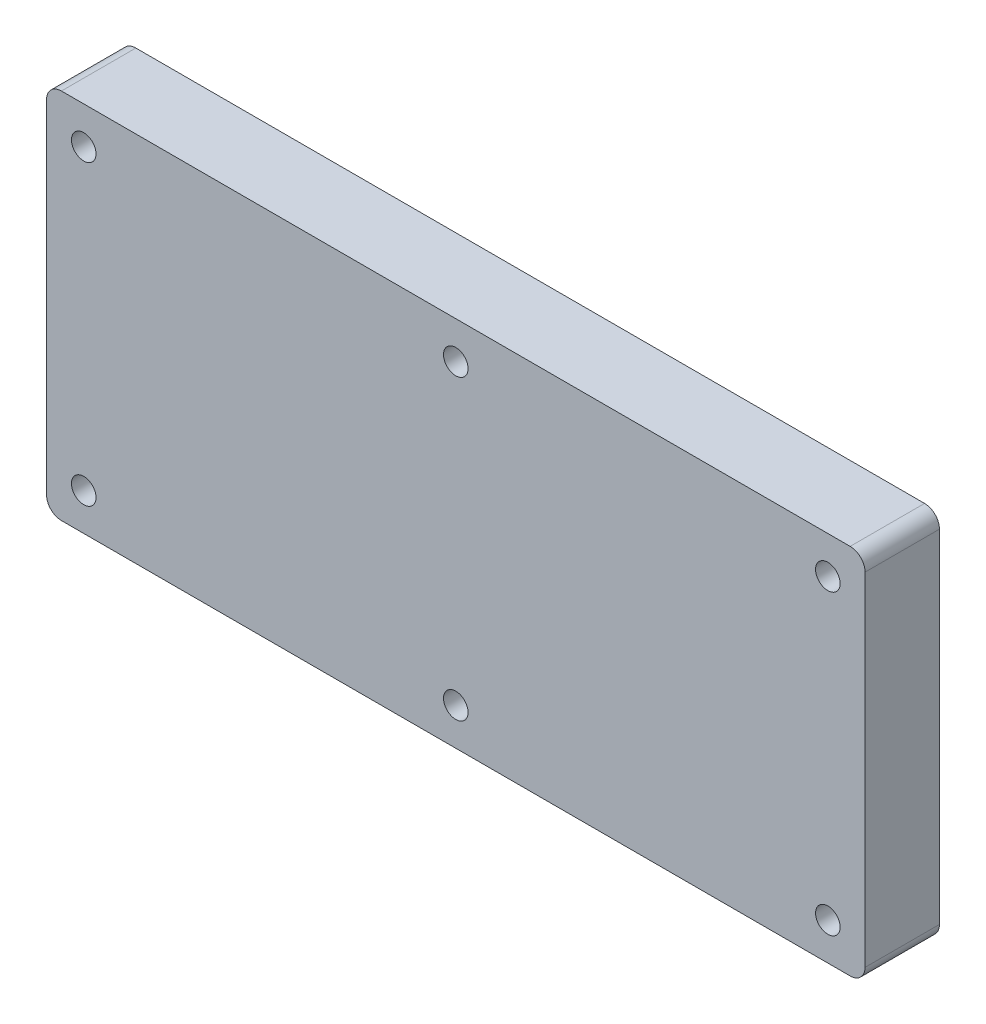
ISO-10303-21;
HEADER;
FILE_DESCRIPTION(('STEP AP214'),'2;1');
FILE_NAME('part.step','',(''),(''),'','','');
FILE_SCHEMA(('AUTOMOTIVE_DESIGN { 1 0 10303 214 1 1 1 1 }'));
ENDSEC;
DATA;
#1=APPLICATION_CONTEXT('core data for automotive mechanical design processes');
#2=APPLICATION_PROTOCOL_DEFINITION('international standard','automotive_design',2000,#1);
#3=PRODUCT_CONTEXT('',#1,'mechanical');
#4=PRODUCT('Part','Part','',(#3));
#5=PRODUCT_RELATED_PRODUCT_CATEGORY('part','',(#4));
#6=PRODUCT_DEFINITION_FORMATION('','',#4);
#7=PRODUCT_DEFINITION_CONTEXT('part definition',#1,'design');
#8=PRODUCT_DEFINITION('design','',#6,#7);
#9=PRODUCT_DEFINITION_SHAPE('','',#8);
#10=(LENGTH_UNIT() NAMED_UNIT(*) SI_UNIT(.MILLI.,.METRE.));
#11=(NAMED_UNIT(*) PLANE_ANGLE_UNIT() SI_UNIT($,.RADIAN.));
#12=(NAMED_UNIT(*) SI_UNIT($,.STERADIAN.) SOLID_ANGLE_UNIT());
#13=UNCERTAINTY_MEASURE_WITH_UNIT(LENGTH_MEASURE(1.E-05),#10,'distance_accuracy_value','');
#14=(GEOMETRIC_REPRESENTATION_CONTEXT(3) GLOBAL_UNCERTAINTY_ASSIGNED_CONTEXT((#13)) GLOBAL_UNIT_ASSIGNED_CONTEXT((#10,
#11,#12)) REPRESENTATION_CONTEXT('',''));
#15=CARTESIAN_POINT('',(0.,0.,0.));
#16=DIRECTION('',(0.,0.,1.));
#17=DIRECTION('',(1.,0.,0.));
#18=AXIS2_PLACEMENT_3D('',#15,#16,#17);
#19=CARTESIAN_POINT('',(55.,25.,10.));
#20=DIRECTION('',(-1.,0.,0.));
#21=DIRECTION('',(0.,-1.,0.));
#22=AXIS2_PLACEMENT_3D('',#19,#20,#21);
#23=PLANE('',#22);
#24=DIRECTION('',(0.,1.,0.));
#25=VECTOR('',#24,1.);
#26=CARTESIAN_POINT('',(55.,25.,0.));
#27=LINE('',#26,#25);
#28=CARTESIAN_POINT('',(55.,-23.,0.));
#29=VERTEX_POINT('',#28);
#30=CARTESIAN_POINT('',(55.,23.,0.));
#31=VERTEX_POINT('',#30);
#32=EDGE_CURVE('E134',#29,#31,#27,.T.);
#33=ORIENTED_EDGE('',*,*,#32,.T.);
#34=DIRECTION('',(0.,0.,-1.));
#35=VECTOR('',#34,1.);
#36=CARTESIAN_POINT('',(55.,23.,10.));
#37=LINE('',#36,#35);
#38=CARTESIAN_POINT('',(55.,23.,10.));
#39=VERTEX_POINT('',#38);
#40=EDGE_CURVE('E112',#31,#39,#37,.F.);
#41=ORIENTED_EDGE('',*,*,#40,.T.);
#42=DIRECTION('',(0.,1.,0.));
#43=VECTOR('',#42,1.);
#44=CARTESIAN_POINT('',(55.,25.,10.));
#45=LINE('',#44,#43);
#46=CARTESIAN_POINT('',(55.,-23.,10.));
#47=VERTEX_POINT('',#46);
#48=EDGE_CURVE('E144',#47,#39,#45,.T.);
#49=ORIENTED_EDGE('',*,*,#48,.F.);
#50=DIRECTION('',(0.,0.,-1.));
#51=VECTOR('',#50,1.);
#52=CARTESIAN_POINT('',(55.,-23.,10.));
#53=LINE('',#52,#51);
#54=EDGE_CURVE('E117',#47,#29,#53,.T.);
#55=ORIENTED_EDGE('',*,*,#54,.T.);
#56=EDGE_LOOP('',(#33,#41,#49,#55));
#57=FACE_BOUND('',#56,.T.);
#58=ADVANCED_FACE('F41',(#57),#23,.F.);
#59=CARTESIAN_POINT('',(-55.,25.,10.));
#60=DIRECTION('',(0.,-1.,0.));
#61=DIRECTION('',(0.,0.,-1.));
#62=AXIS2_PLACEMENT_3D('',#59,#60,#61);
#63=PLANE('',#62);
#64=DIRECTION('',(-1.,0.,0.));
#65=VECTOR('',#64,1.);
#66=CARTESIAN_POINT('',(-55.,25.,10.));
#67=LINE('',#66,#65);
#68=CARTESIAN_POINT('',(53.,25.,10.));
#69=VERTEX_POINT('',#68);
#70=CARTESIAN_POINT('',(-53.,25.,10.));
#71=VERTEX_POINT('',#70);
#72=EDGE_CURVE('E127',#69,#71,#67,.T.);
#73=ORIENTED_EDGE('',*,*,#72,.F.);
#74=DIRECTION('',(0.,0.,-1.));
#75=VECTOR('',#74,1.);
#76=CARTESIAN_POINT('',(53.,25.,10.));
#77=LINE('',#76,#75);
#78=CARTESIAN_POINT('',(53.,25.,0.));
#79=VERTEX_POINT('',#78);
#80=EDGE_CURVE('E111',#69,#79,#77,.T.);
#81=ORIENTED_EDGE('',*,*,#80,.T.);
#82=DIRECTION('',(-1.,0.,0.));
#83=VECTOR('',#82,1.);
#84=CARTESIAN_POINT('',(-55.,25.,0.));
#85=LINE('',#84,#83);
#86=CARTESIAN_POINT('',(-53.,25.,0.));
#87=VERTEX_POINT('',#86);
#88=EDGE_CURVE('E124',#79,#87,#85,.T.);
#89=ORIENTED_EDGE('',*,*,#88,.T.);
#90=DIRECTION('',(0.,0.,-1.));
#91=VECTOR('',#90,1.);
#92=CARTESIAN_POINT('',(-53.,25.,10.));
#93=LINE('',#92,#91);
#94=EDGE_CURVE('E129',#87,#71,#93,.F.);
#95=ORIENTED_EDGE('',*,*,#94,.T.);
#96=EDGE_LOOP('',(#73,#81,#89,#95));
#97=FACE_BOUND('',#96,.T.);
#98=ADVANCED_FACE('F123',(#97),#63,.F.);
#99=CARTESIAN_POINT('',(-55.,25.,10.));
#100=DIRECTION('',(1.,0.,0.));
#101=DIRECTION('',(0.,1.,0.));
#102=AXIS2_PLACEMENT_3D('',#99,#100,#101);
#103=PLANE('',#102);
#104=DIRECTION('',(0.,-1.,0.));
#105=VECTOR('',#104,1.);
#106=CARTESIAN_POINT('',(-55.,25.,0.));
#107=LINE('',#106,#105);
#108=CARTESIAN_POINT('',(-55.,23.,0.));
#109=VERTEX_POINT('',#108);
#110=CARTESIAN_POINT('',(-55.,-23.,0.));
#111=VERTEX_POINT('',#110);
#112=EDGE_CURVE('E133',#109,#111,#107,.T.);
#113=ORIENTED_EDGE('',*,*,#112,.T.);
#114=DIRECTION('',(0.,0.,-1.));
#115=VECTOR('',#114,1.);
#116=CARTESIAN_POINT('',(-55.,-23.,10.));
#117=LINE('',#116,#115);
#118=CARTESIAN_POINT('',(-55.,-23.,10.));
#119=VERTEX_POINT('',#118);
#120=EDGE_CURVE('E11',#111,#119,#117,.F.);
#121=ORIENTED_EDGE('',*,*,#120,.T.);
#122=DIRECTION('',(0.,-1.,0.));
#123=VECTOR('',#122,1.);
#124=CARTESIAN_POINT('',(-55.,25.,10.));
#125=LINE('',#124,#123);
#126=CARTESIAN_POINT('',(-55.,23.,10.));
#127=VERTEX_POINT('',#126);
#128=EDGE_CURVE('E170',#127,#119,#125,.T.);
#129=ORIENTED_EDGE('',*,*,#128,.F.);
#130=DIRECTION('',(0.,0.,-1.));
#131=VECTOR('',#130,1.);
#132=CARTESIAN_POINT('',(-55.,23.,10.));
#133=LINE('',#132,#131);
#134=EDGE_CURVE('E49',#127,#109,#133,.T.);
#135=ORIENTED_EDGE('',*,*,#134,.T.);
#136=EDGE_LOOP('',(#113,#121,#129,#135));
#137=FACE_BOUND('',#136,.T.);
#138=ADVANCED_FACE('F168',(#137),#103,.F.);
#139=CARTESIAN_POINT('',(-55.,-25.,10.));
#140=DIRECTION('',(0.,1.,0.));
#141=DIRECTION('',(0.,0.,1.));
#142=AXIS2_PLACEMENT_3D('',#139,#140,#141);
#143=PLANE('',#142);
#144=DIRECTION('',(1.,0.,0.));
#145=VECTOR('',#144,1.);
#146=CARTESIAN_POINT('',(-55.,-25.,0.));
#147=LINE('',#146,#145);
#148=CARTESIAN_POINT('',(-53.,-25.,0.));
#149=VERTEX_POINT('',#148);
#150=CARTESIAN_POINT('',(53.,-25.,0.));
#151=VERTEX_POINT('',#150);
#152=EDGE_CURVE('E137',#149,#151,#147,.T.);
#153=ORIENTED_EDGE('',*,*,#152,.T.);
#154=DIRECTION('',(0.,0.,-1.));
#155=VECTOR('',#154,1.);
#156=CARTESIAN_POINT('',(53.,-25.,10.));
#157=LINE('',#156,#155);
#158=CARTESIAN_POINT('',(53.,-25.,10.));
#159=VERTEX_POINT('',#158);
#160=EDGE_CURVE('E56',#151,#159,#157,.F.);
#161=ORIENTED_EDGE('',*,*,#160,.T.);
#162=DIRECTION('',(1.,0.,0.));
#163=VECTOR('',#162,1.);
#164=CARTESIAN_POINT('',(-55.,-25.,10.));
#165=LINE('',#164,#163);
#166=CARTESIAN_POINT('',(-53.,-25.,10.));
#167=VERTEX_POINT('',#166);
#168=EDGE_CURVE('E145',#167,#159,#165,.T.);
#169=ORIENTED_EDGE('',*,*,#168,.F.);
#170=DIRECTION('',(0.,0.,-1.));
#171=VECTOR('',#170,1.);
#172=CARTESIAN_POINT('',(-53.,-25.,10.));
#173=LINE('',#172,#171);
#174=EDGE_CURVE('E161',#167,#149,#173,.T.);
#175=ORIENTED_EDGE('',*,*,#174,.T.);
#176=EDGE_LOOP('',(#153,#161,#169,#175));
#177=FACE_BOUND('',#176,.T.);
#178=ADVANCED_FACE('F177',(#177),#143,.F.);
#179=CARTESIAN_POINT('',(0.,0.,10.));
#180=DIRECTION('',(0.,0.,1.));
#181=DIRECTION('',(1.,0.,0.));
#182=AXIS2_PLACEMENT_3D('',#179,#180,#181);
#183=PLANE('',#182);
#184=CARTESIAN_POINT('',(-50.,20.,10.));
#185=DIRECTION('',(0.,0.,1.));
#186=DIRECTION('',(1.,0.,0.));
#187=AXIS2_PLACEMENT_3D('',#184,#185,#186);
#188=CIRCLE('',#187,1.64999999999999);
#189=CARTESIAN_POINT('',(-48.35,20.,10.));
#190=VERTEX_POINT('',#189);
#191=EDGE_CURVE('E216',#190,#190,#188,.T.);
#192=ORIENTED_EDGE('',*,*,#191,.F.);
#193=EDGE_LOOP('',(#192));
#194=FACE_BOUND('',#193,.T.);
#195=CARTESIAN_POINT('',(0.,20.,10.));
#196=DIRECTION('',(0.,0.,1.));
#197=DIRECTION('',(1.,0.,0.));
#198=AXIS2_PLACEMENT_3D('',#195,#196,#197);
#199=CIRCLE('',#198,1.64999999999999);
#200=CARTESIAN_POINT('',(1.64999999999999,20.,10.));
#201=VERTEX_POINT('',#200);
#202=EDGE_CURVE('E210',#201,#201,#199,.T.);
#203=ORIENTED_EDGE('',*,*,#202,.F.);
#204=EDGE_LOOP('',(#203));
#205=FACE_BOUND('',#204,.T.);
#206=CARTESIAN_POINT('',(50.,20.,10.));
#207=DIRECTION('',(0.,0.,1.));
#208=DIRECTION('',(1.,0.,0.));
#209=AXIS2_PLACEMENT_3D('',#206,#207,#208);
#210=CIRCLE('',#209,1.64999999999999);
#211=CARTESIAN_POINT('',(51.65,20.,10.));
#212=VERTEX_POINT('',#211);
#213=EDGE_CURVE('E204',#212,#212,#210,.T.);
#214=ORIENTED_EDGE('',*,*,#213,.F.);
#215=EDGE_LOOP('',(#214));
#216=FACE_BOUND('',#215,.T.);
#217=CARTESIAN_POINT('',(-50.,-20.,10.));
#218=DIRECTION('',(0.,0.,1.));
#219=DIRECTION('',(1.,0.,0.));
#220=AXIS2_PLACEMENT_3D('',#217,#218,#219);
#221=CIRCLE('',#220,1.64999999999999);
#222=CARTESIAN_POINT('',(-48.35,-20.,10.));
#223=VERTEX_POINT('',#222);
#224=EDGE_CURVE('E198',#223,#223,#221,.T.);
#225=ORIENTED_EDGE('',*,*,#224,.F.);
#226=EDGE_LOOP('',(#225));
#227=FACE_BOUND('',#226,.T.);
#228=CARTESIAN_POINT('',(0.,-20.,10.));
#229=DIRECTION('',(0.,0.,1.));
#230=DIRECTION('',(1.,0.,0.));
#231=AXIS2_PLACEMENT_3D('',#228,#229,#230);
#232=CIRCLE('',#231,1.64999999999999);
#233=CARTESIAN_POINT('',(1.64999999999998,-20.,10.));
#234=VERTEX_POINT('',#233);
#235=EDGE_CURVE('E192',#234,#234,#232,.T.);
#236=ORIENTED_EDGE('',*,*,#235,.F.);
#237=EDGE_LOOP('',(#236));
#238=FACE_BOUND('',#237,.T.);
#239=CARTESIAN_POINT('',(50.,-20.,10.));
#240=DIRECTION('',(0.,0.,1.));
#241=DIRECTION('',(1.,0.,0.));
#242=AXIS2_PLACEMENT_3D('',#239,#240,#241);
#243=CIRCLE('',#242,1.64999999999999);
#244=CARTESIAN_POINT('',(51.65,-20.,10.));
#245=VERTEX_POINT('',#244);
#246=EDGE_CURVE('E186',#245,#245,#243,.T.);
#247=ORIENTED_EDGE('',*,*,#246,.F.);
#248=EDGE_LOOP('',(#247));
#249=FACE_BOUND('',#248,.T.);
#250=ORIENTED_EDGE('',*,*,#48,.T.);
#251=CARTESIAN_POINT('',(53.,23.,10.));
#252=DIRECTION('',(0.,0.,1.));
#253=DIRECTION('',(1.,0.,0.));
#254=AXIS2_PLACEMENT_3D('',#251,#252,#253);
#255=CIRCLE('',#254,2.);
#256=EDGE_CURVE('E159',#39,#69,#255,.T.);
#257=ORIENTED_EDGE('',*,*,#256,.T.);
#258=ORIENTED_EDGE('',*,*,#72,.T.);
#259=CARTESIAN_POINT('',(-53.,23.,10.));
#260=DIRECTION('',(0.,0.,1.));
#261=DIRECTION('',(1.,0.,0.));
#262=AXIS2_PLACEMENT_3D('',#259,#260,#261);
#263=CIRCLE('',#262,2.);
#264=EDGE_CURVE('E154',#71,#127,#263,.T.);
#265=ORIENTED_EDGE('',*,*,#264,.T.);
#266=ORIENTED_EDGE('',*,*,#128,.T.);
#267=CARTESIAN_POINT('',(-53.,-23.,10.));
#268=DIRECTION('',(0.,0.,1.));
#269=DIRECTION('',(1.,0.,0.));
#270=AXIS2_PLACEMENT_3D('',#267,#268,#269);
#271=CIRCLE('',#270,2.);
#272=EDGE_CURVE('E63',#119,#167,#271,.T.);
#273=ORIENTED_EDGE('',*,*,#272,.T.);
#274=ORIENTED_EDGE('',*,*,#168,.T.);
#275=CARTESIAN_POINT('',(53.,-23.,10.));
#276=DIRECTION('',(0.,0.,1.));
#277=DIRECTION('',(1.,0.,0.));
#278=AXIS2_PLACEMENT_3D('',#275,#276,#277);
#279=CIRCLE('',#278,2.);
#280=EDGE_CURVE('E157',#159,#47,#279,.T.);
#281=ORIENTED_EDGE('',*,*,#280,.T.);
#282=EDGE_LOOP('',(#250,#257,#258,#265,#266,#273,#274,#281));
#283=FACE_BOUND('',#282,.T.);
#284=ADVANCED_FACE('F222',(#194,#205,#216,#227,#238,#249,#283),#183,.T.);
#285=CARTESIAN_POINT('',(0.,0.,0.));
#286=DIRECTION('',(0.,0.,1.));
#287=DIRECTION('',(1.,0.,0.));
#288=AXIS2_PLACEMENT_3D('',#285,#286,#287);
#289=PLANE('',#288);
#290=CARTESIAN_POINT('',(-50.,20.,0.));
#291=DIRECTION('',(0.,0.,1.));
#292=DIRECTION('',(1.,0.,0.));
#293=AXIS2_PLACEMENT_3D('',#290,#291,#292);
#294=CIRCLE('',#293,1.65);
#295=CARTESIAN_POINT('',(-48.35,20.,0.));
#296=VERTEX_POINT('',#295);
#297=EDGE_CURVE('E213',#296,#296,#294,.T.);
#298=ORIENTED_EDGE('',*,*,#297,.T.);
#299=EDGE_LOOP('',(#298));
#300=FACE_BOUND('',#299,.T.);
#301=CARTESIAN_POINT('',(0.,20.,0.));
#302=DIRECTION('',(0.,0.,1.));
#303=DIRECTION('',(1.,0.,0.));
#304=AXIS2_PLACEMENT_3D('',#301,#302,#303);
#305=CIRCLE('',#304,1.65);
#306=CARTESIAN_POINT('',(1.65,20.,0.));
#307=VERTEX_POINT('',#306);
#308=EDGE_CURVE('E207',#307,#307,#305,.T.);
#309=ORIENTED_EDGE('',*,*,#308,.T.);
#310=EDGE_LOOP('',(#309));
#311=FACE_BOUND('',#310,.T.);
#312=CARTESIAN_POINT('',(50.,20.,0.));
#313=DIRECTION('',(0.,0.,1.));
#314=DIRECTION('',(1.,0.,0.));
#315=AXIS2_PLACEMENT_3D('',#312,#313,#314);
#316=CIRCLE('',#315,1.65);
#317=CARTESIAN_POINT('',(51.65,20.,0.));
#318=VERTEX_POINT('',#317);
#319=EDGE_CURVE('E201',#318,#318,#316,.T.);
#320=ORIENTED_EDGE('',*,*,#319,.T.);
#321=EDGE_LOOP('',(#320));
#322=FACE_BOUND('',#321,.T.);
#323=CARTESIAN_POINT('',(-50.,-20.,0.));
#324=DIRECTION('',(0.,0.,1.));
#325=DIRECTION('',(1.,0.,0.));
#326=AXIS2_PLACEMENT_3D('',#323,#324,#325);
#327=CIRCLE('',#326,1.65);
#328=CARTESIAN_POINT('',(-48.35,-20.,0.));
#329=VERTEX_POINT('',#328);
#330=EDGE_CURVE('E195',#329,#329,#327,.T.);
#331=ORIENTED_EDGE('',*,*,#330,.T.);
#332=EDGE_LOOP('',(#331));
#333=FACE_BOUND('',#332,.T.);
#334=CARTESIAN_POINT('',(0.,-20.,0.));
#335=DIRECTION('',(0.,0.,1.));
#336=DIRECTION('',(1.,0.,0.));
#337=AXIS2_PLACEMENT_3D('',#334,#335,#336);
#338=CIRCLE('',#337,1.65);
#339=CARTESIAN_POINT('',(1.64999999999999,-20.,0.));
#340=VERTEX_POINT('',#339);
#341=EDGE_CURVE('E189',#340,#340,#338,.T.);
#342=ORIENTED_EDGE('',*,*,#341,.T.);
#343=EDGE_LOOP('',(#342));
#344=FACE_BOUND('',#343,.T.);
#345=CARTESIAN_POINT('',(50.,-20.,0.));
#346=DIRECTION('',(0.,0.,1.));
#347=DIRECTION('',(1.,0.,0.));
#348=AXIS2_PLACEMENT_3D('',#345,#346,#347);
#349=CIRCLE('',#348,1.65);
#350=CARTESIAN_POINT('',(51.65,-20.,0.));
#351=VERTEX_POINT('',#350);
#352=EDGE_CURVE('E139',#351,#351,#349,.T.);
#353=ORIENTED_EDGE('',*,*,#352,.T.);
#354=EDGE_LOOP('',(#353));
#355=FACE_BOUND('',#354,.T.);
#356=ORIENTED_EDGE('',*,*,#88,.F.);
#357=CARTESIAN_POINT('',(53.,23.,0.));
#358=DIRECTION('',(0.,0.,1.));
#359=DIRECTION('',(1.,0.,0.));
#360=AXIS2_PLACEMENT_3D('',#357,#358,#359);
#361=CIRCLE('',#360,2.);
#362=EDGE_CURVE('E107',#79,#31,#361,.F.);
#363=ORIENTED_EDGE('',*,*,#362,.T.);
#364=ORIENTED_EDGE('',*,*,#32,.F.);
#365=CARTESIAN_POINT('',(53.,-23.,0.));
#366=DIRECTION('',(0.,0.,1.));
#367=DIRECTION('',(1.,0.,0.));
#368=AXIS2_PLACEMENT_3D('',#365,#366,#367);
#369=CIRCLE('',#368,2.);
#370=EDGE_CURVE('E118',#29,#151,#369,.F.);
#371=ORIENTED_EDGE('',*,*,#370,.T.);
#372=ORIENTED_EDGE('',*,*,#152,.F.);
#373=CARTESIAN_POINT('',(-53.,-23.,0.));
#374=DIRECTION('',(0.,0.,1.));
#375=DIRECTION('',(1.,0.,0.));
#376=AXIS2_PLACEMENT_3D('',#373,#374,#375);
#377=CIRCLE('',#376,2.);
#378=EDGE_CURVE('E148',#149,#111,#377,.F.);
#379=ORIENTED_EDGE('',*,*,#378,.T.);
#380=ORIENTED_EDGE('',*,*,#112,.F.);
#381=CARTESIAN_POINT('',(-53.,23.,0.));
#382=DIRECTION('',(0.,0.,1.));
#383=DIRECTION('',(1.,0.,0.));
#384=AXIS2_PLACEMENT_3D('',#381,#382,#383);
#385=CIRCLE('',#384,2.);
#386=EDGE_CURVE('E128',#109,#87,#385,.F.);
#387=ORIENTED_EDGE('',*,*,#386,.T.);
#388=EDGE_LOOP('',(#356,#363,#364,#371,#372,#379,#380,#387));
#389=FACE_BOUND('',#388,.T.);
#390=ADVANCED_FACE('F131',(#300,#311,#322,#333,#344,#355,#389),#289,.F.);
#391=CARTESIAN_POINT('',(50.,-20.,10.));
#392=DIRECTION('',(0.,0.,1.));
#393=DIRECTION('',(1.,0.,0.));
#394=AXIS2_PLACEMENT_3D('',#391,#392,#393);
#395=CYLINDRICAL_SURFACE('',#394,1.65);
#396=ORIENTED_EDGE('',*,*,#352,.F.);
#397=EDGE_LOOP('',(#396));
#398=FACE_BOUND('',#397,.T.);
#399=ORIENTED_EDGE('',*,*,#246,.T.);
#400=EDGE_LOOP('',(#399));
#401=FACE_BOUND('',#400,.T.);
#402=ADVANCED_FACE('F259',(#398,#401),#395,.F.);
#403=CARTESIAN_POINT('',(0.,-20.,10.));
#404=DIRECTION('',(0.,0.,1.));
#405=DIRECTION('',(1.,0.,0.));
#406=AXIS2_PLACEMENT_3D('',#403,#404,#405);
#407=CYLINDRICAL_SURFACE('',#406,1.64999999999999);
#408=ORIENTED_EDGE('',*,*,#341,.F.);
#409=EDGE_LOOP('',(#408));
#410=FACE_BOUND('',#409,.T.);
#411=ORIENTED_EDGE('',*,*,#235,.T.);
#412=EDGE_LOOP('',(#411));
#413=FACE_BOUND('',#412,.T.);
#414=ADVANCED_FACE('F264',(#410,#413),#407,.F.);
#415=CARTESIAN_POINT('',(-50.,-20.,10.));
#416=DIRECTION('',(0.,0.,1.));
#417=DIRECTION('',(1.,0.,0.));
#418=AXIS2_PLACEMENT_3D('',#415,#416,#417);
#419=CYLINDRICAL_SURFACE('',#418,1.65);
#420=ORIENTED_EDGE('',*,*,#330,.F.);
#421=EDGE_LOOP('',(#420));
#422=FACE_BOUND('',#421,.T.);
#423=ORIENTED_EDGE('',*,*,#224,.T.);
#424=EDGE_LOOP('',(#423));
#425=FACE_BOUND('',#424,.T.);
#426=ADVANCED_FACE('F268',(#422,#425),#419,.F.);
#427=CARTESIAN_POINT('',(50.,20.,10.));
#428=DIRECTION('',(0.,0.,1.));
#429=DIRECTION('',(1.,0.,0.));
#430=AXIS2_PLACEMENT_3D('',#427,#428,#429);
#431=CYLINDRICAL_SURFACE('',#430,1.65);
#432=ORIENTED_EDGE('',*,*,#319,.F.);
#433=EDGE_LOOP('',(#432));
#434=FACE_BOUND('',#433,.T.);
#435=ORIENTED_EDGE('',*,*,#213,.T.);
#436=EDGE_LOOP('',(#435));
#437=FACE_BOUND('',#436,.T.);
#438=ADVANCED_FACE('F272',(#434,#437),#431,.F.);
#439=CARTESIAN_POINT('',(0.,20.,10.));
#440=DIRECTION('',(0.,0.,1.));
#441=DIRECTION('',(1.,0.,0.));
#442=AXIS2_PLACEMENT_3D('',#439,#440,#441);
#443=CYLINDRICAL_SURFACE('',#442,1.64999999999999);
#444=ORIENTED_EDGE('',*,*,#308,.F.);
#445=EDGE_LOOP('',(#444));
#446=FACE_BOUND('',#445,.T.);
#447=ORIENTED_EDGE('',*,*,#202,.T.);
#448=EDGE_LOOP('',(#447));
#449=FACE_BOUND('',#448,.T.);
#450=ADVANCED_FACE('F276',(#446,#449),#443,.F.);
#451=CARTESIAN_POINT('',(-50.,20.,10.));
#452=DIRECTION('',(0.,0.,1.));
#453=DIRECTION('',(1.,0.,0.));
#454=AXIS2_PLACEMENT_3D('',#451,#452,#453);
#455=CYLINDRICAL_SURFACE('',#454,1.65);
#456=ORIENTED_EDGE('',*,*,#297,.F.);
#457=EDGE_LOOP('',(#456));
#458=FACE_BOUND('',#457,.T.);
#459=ORIENTED_EDGE('',*,*,#191,.T.);
#460=EDGE_LOOP('',(#459));
#461=FACE_BOUND('',#460,.T.);
#462=ADVANCED_FACE('F220',(#458,#461),#455,.F.);
#463=CARTESIAN_POINT('',(53.,23.,10.));
#464=DIRECTION('',(0.,0.,-1.));
#465=DIRECTION('',(-1.,0.,0.));
#466=AXIS2_PLACEMENT_3D('',#463,#464,#465);
#467=CYLINDRICAL_SURFACE('',#466,2.);
#468=ORIENTED_EDGE('',*,*,#256,.F.);
#469=ORIENTED_EDGE('',*,*,#40,.F.);
#470=ORIENTED_EDGE('',*,*,#362,.F.);
#471=ORIENTED_EDGE('',*,*,#80,.F.);
#472=EDGE_LOOP('',(#468,#469,#470,#471));
#473=FACE_BOUND('',#472,.T.);
#474=ADVANCED_FACE('F110',(#473),#467,.T.);
#475=CARTESIAN_POINT('',(53.,-23.,10.));
#476=DIRECTION('',(0.,0.,-1.));
#477=DIRECTION('',(-1.,0.,0.));
#478=AXIS2_PLACEMENT_3D('',#475,#476,#477);
#479=CYLINDRICAL_SURFACE('',#478,2.);
#480=ORIENTED_EDGE('',*,*,#280,.F.);
#481=ORIENTED_EDGE('',*,*,#160,.F.);
#482=ORIENTED_EDGE('',*,*,#370,.F.);
#483=ORIENTED_EDGE('',*,*,#54,.F.);
#484=EDGE_LOOP('',(#480,#481,#482,#483));
#485=FACE_BOUND('',#484,.T.);
#486=ADVANCED_FACE('F239',(#485),#479,.T.);
#487=CARTESIAN_POINT('',(-53.,-23.,10.));
#488=DIRECTION('',(0.,0.,-1.));
#489=DIRECTION('',(-1.,0.,0.));
#490=AXIS2_PLACEMENT_3D('',#487,#488,#489);
#491=CYLINDRICAL_SURFACE('',#490,2.);
#492=ORIENTED_EDGE('',*,*,#272,.F.);
#493=ORIENTED_EDGE('',*,*,#120,.F.);
#494=ORIENTED_EDGE('',*,*,#378,.F.);
#495=ORIENTED_EDGE('',*,*,#174,.F.);
#496=EDGE_LOOP('',(#492,#493,#494,#495));
#497=FACE_BOUND('',#496,.T.);
#498=ADVANCED_FACE('F176',(#497),#491,.T.);
#499=CARTESIAN_POINT('',(-53.,23.,10.));
#500=DIRECTION('',(0.,0.,-1.));
#501=DIRECTION('',(-1.,0.,0.));
#502=AXIS2_PLACEMENT_3D('',#499,#500,#501);
#503=CYLINDRICAL_SURFACE('',#502,2.);
#504=ORIENTED_EDGE('',*,*,#264,.F.);
#505=ORIENTED_EDGE('',*,*,#94,.F.);
#506=ORIENTED_EDGE('',*,*,#386,.F.);
#507=ORIENTED_EDGE('',*,*,#134,.F.);
#508=EDGE_LOOP('',(#504,#505,#506,#507));
#509=FACE_BOUND('',#508,.T.);
#510=ADVANCED_FACE('F43',(#509),#503,.T.);
#511=CLOSED_SHELL('',(#58,#98,#138,#178,#284,#390,#402,#414,#426,#438,#450,#462,#474,#486,#498,#510));
#512=MANIFOLD_SOLID_BREP('B2',#511);
#513=ADVANCED_BREP_SHAPE_REPRESENTATION('',(#18,#512),#14);
#514=SHAPE_DEFINITION_REPRESENTATION(#9,#513);
ENDSEC;
END-ISO-10303-21;
